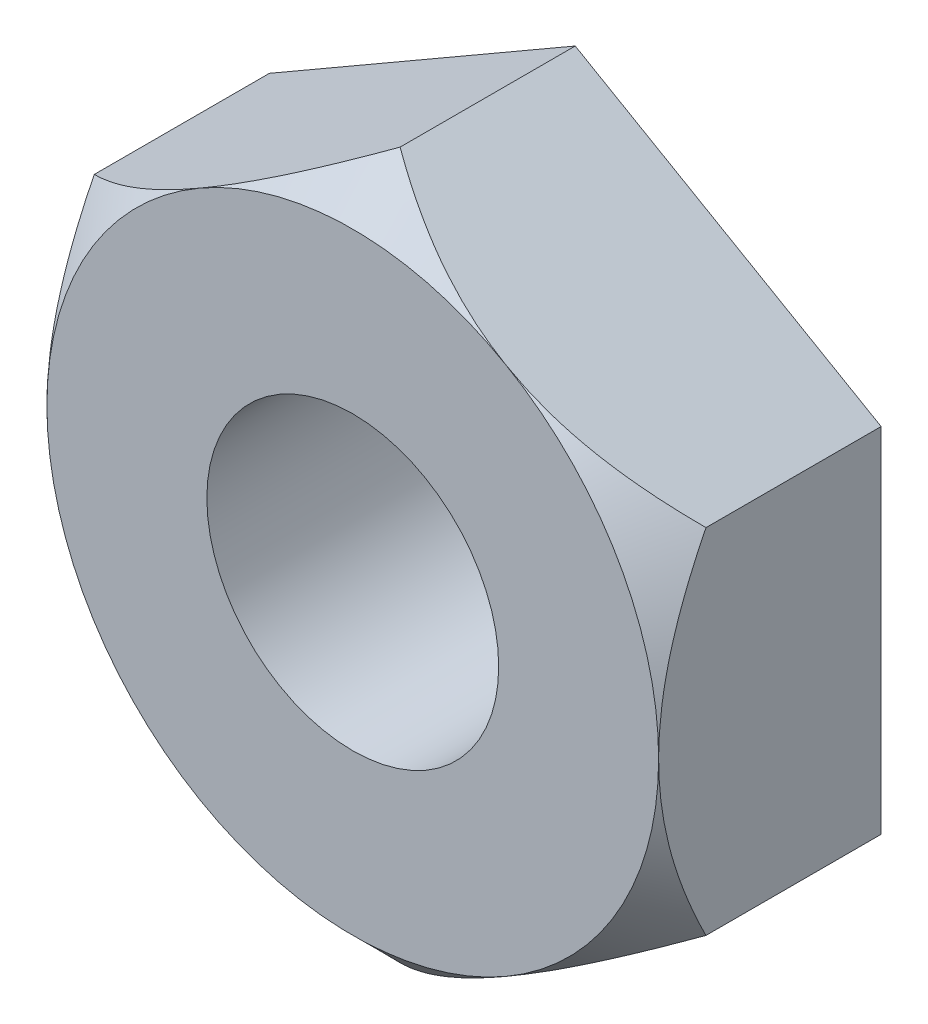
from build123d import *

# Parameters (mm, degrees)
SKETCH1_R         = 2.0828
NUT_DEPTH         = 3.175
SKETCH2_OUTSIDE_W = 30.246
SKETCH2_OUTSIDE_H = 31.596
SKETCH2_OUTSIDE_R = 4.365625
CUT_DEPTH         = 8.385856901
CUT_DRAFT         = -45


with BuildPart() as part:
    # Sketch1 → Nut (new body)
    with BuildSketch(Plane.XY):
        Polygon((0, 5.040989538), (4.365625, 2.520494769), (4.365625, -2.520494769), (0, -5.040989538), (-4.365625, -2.520494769), (-4.365625, 2.520494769), align=None)
        Circle(SKETCH1_R, mode=Mode.SUBTRACT)
    extrude(amount=NUT_DEPTH)


with BuildPart() as cut_tool:
    # Sketch2 outside → Cut (with draft: the straight prism first)
    with BuildSketch(Plane.XY.offset(3.175)):
        Rectangle(SKETCH2_OUTSIDE_W, SKETCH2_OUTSIDE_H)
        Circle(SKETCH2_OUTSIDE_R, mode=Mode.SUBTRACT)
    extrude(amount=-CUT_DEPTH)
    # Cut: the draft: its side faces are tilted about the plane it starts from
    cut_sides = [cut_tool.faces().sort_by_distance(p)[0] for p in [
        (0, -15.798, -1.01792845),
        (15.123, 0, -1.01792845),
        (0, 15.798, -1.01792845),
        (-15.123, 0, -1.01792845),
        (-4.365625, 0, -1.01792845),
    ]]
    draft(cut_sides, Plane.XY.offset(3.175), CUT_DRAFT)


with BuildPart() as part_1:
    add(part.part)

    # Cut: cut by cut_tool
    add(cut_tool.part, mode=Mode.SUBTRACT)


solid = part_1.part
